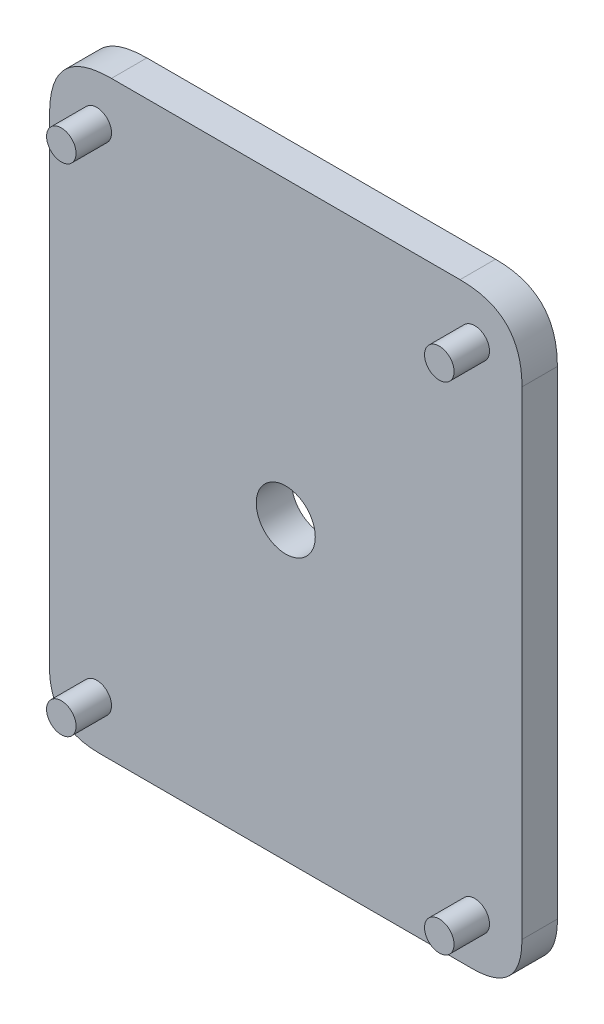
ISO-10303-21;
HEADER;
FILE_DESCRIPTION(('STEP AP214'),'2;1');
FILE_NAME('part.step','',(''),(''),'','','');
FILE_SCHEMA(('AUTOMOTIVE_DESIGN { 1 0 10303 214 1 1 1 1 }'));
ENDSEC;
DATA;
#1=APPLICATION_CONTEXT('core data for automotive mechanical design processes');
#2=APPLICATION_PROTOCOL_DEFINITION('international standard','automotive_design',2000,#1);
#3=PRODUCT_CONTEXT('',#1,'mechanical');
#4=PRODUCT('Part','Part','',(#3));
#5=PRODUCT_RELATED_PRODUCT_CATEGORY('part','',(#4));
#6=PRODUCT_DEFINITION_FORMATION('','',#4);
#7=PRODUCT_DEFINITION_CONTEXT('part definition',#1,'design');
#8=PRODUCT_DEFINITION('design','',#6,#7);
#9=PRODUCT_DEFINITION_SHAPE('','',#8);
#10=(LENGTH_UNIT() NAMED_UNIT(*) SI_UNIT(.MILLI.,.METRE.));
#11=(NAMED_UNIT(*) PLANE_ANGLE_UNIT() SI_UNIT($,.RADIAN.));
#12=(NAMED_UNIT(*) SI_UNIT($,.STERADIAN.) SOLID_ANGLE_UNIT());
#13=UNCERTAINTY_MEASURE_WITH_UNIT(LENGTH_MEASURE(1.E-05),#10,'distance_accuracy_value','');
#14=(GEOMETRIC_REPRESENTATION_CONTEXT(3) GLOBAL_UNCERTAINTY_ASSIGNED_CONTEXT((#13)) GLOBAL_UNIT_ASSIGNED_CONTEXT((#10,
#11,#12)) REPRESENTATION_CONTEXT('',''));
#15=CARTESIAN_POINT('',(0.,0.,0.));
#16=DIRECTION('',(0.,0.,1.));
#17=DIRECTION('',(1.,0.,0.));
#18=AXIS2_PLACEMENT_3D('',#15,#16,#17);
#19=CARTESIAN_POINT('',(20.,0.,3.));
#20=DIRECTION('',(1.,0.,0.));
#21=DIRECTION('',(0.,1.,0.));
#22=AXIS2_PLACEMENT_3D('',#19,#20,#21);
#23=PLANE('',#22);
#24=DIRECTION('',(0.,-1.,0.));
#25=VECTOR('',#24,1.);
#26=CARTESIAN_POINT('',(20.,0.,3.));
#27=LINE('',#26,#25);
#28=CARTESIAN_POINT('',(20.,19.75736,3.));
#29=VERTEX_POINT('',#28);
#30=CARTESIAN_POINT('',(20.,-20.75736,3.));
#31=VERTEX_POINT('',#30);
#32=EDGE_CURVE('E10',#29,#31,#27,.T.);
#33=ORIENTED_EDGE('',*,*,#32,.T.);
#34=CARTESIAN_POINT('',(20.,-20.75736,-0.15));
#35=CARTESIAN_POINT('',(20.,-20.75736,0.95));
#36=CARTESIAN_POINT('',(20.,-20.75736,2.05));
#37=CARTESIAN_POINT('',(20.,-20.75736,3.15));
#38=B_SPLINE_CURVE_WITH_KNOTS('',3,(#34,#35,#36,#37),.UNSPECIFIED.,.F.,.F.,(4,4),(-0.00015,
0.00315),.UNSPECIFIED.);
#39=CARTESIAN_POINT('',(20.,-20.75736,0.));
#40=VERTEX_POINT('',#39);
#41=EDGE_CURVE('E25',#31,#40,#38,.F.);
#42=ORIENTED_EDGE('',*,*,#41,.T.);
#43=DIRECTION('',(0.,-1.,0.));
#44=VECTOR('',#43,1.);
#45=CARTESIAN_POINT('',(20.,0.,0.));
#46=LINE('',#45,#44);
#47=CARTESIAN_POINT('',(20.,19.75736,0.));
#48=VERTEX_POINT('',#47);
#49=EDGE_CURVE('E231',#48,#40,#46,.T.);
#50=ORIENTED_EDGE('',*,*,#49,.F.);
#51=CARTESIAN_POINT('',(20.,19.75736,3.15));
#52=CARTESIAN_POINT('',(20.,19.75736,2.05));
#53=CARTESIAN_POINT('',(20.,19.75736,0.95));
#54=CARTESIAN_POINT('',(20.,19.75736,-0.15));
#55=B_SPLINE_CURVE_WITH_KNOTS('',3,(#51,#52,#53,#54),.UNSPECIFIED.,.F.,.F.,(4,4),(-0.00315,
0.00015),.UNSPECIFIED.);
#56=EDGE_CURVE('E418',#48,#29,#55,.F.);
#57=ORIENTED_EDGE('',*,*,#56,.T.);
#58=EDGE_LOOP('',(#33,#42,#50,#57));
#59=FACE_BOUND('',#58,.T.);
#60=ADVANCED_FACE('F16',(#59),#23,.T.);
#61=CARTESIAN_POINT('',(0.,25.,3.));
#62=DIRECTION('',(0.,-1.,0.));
#63=DIRECTION('',(0.,0.,-1.));
#64=AXIS2_PLACEMENT_3D('',#61,#62,#63);
#65=PLANE('',#64);
#66=DIRECTION('',(-1.,0.,0.));
#67=VECTOR('',#66,1.);
#68=CARTESIAN_POINT('',(0.,25.,0.));
#69=LINE('',#68,#67);
#70=CARTESIAN_POINT('',(14.75736,25.,0.));
#71=VERTEX_POINT('',#70);
#72=CARTESIAN_POINT('',(-14.75736,25.,0.));
#73=VERTEX_POINT('',#72);
#74=EDGE_CURVE('E276',#71,#73,#69,.T.);
#75=ORIENTED_EDGE('',*,*,#74,.T.);
#76=CARTESIAN_POINT('',(-14.75736,25.,3.15));
#77=CARTESIAN_POINT('',(-14.75736,25.,2.05));
#78=CARTESIAN_POINT('',(-14.75736,25.,0.95));
#79=CARTESIAN_POINT('',(-14.75736,25.,-0.15));
#80=B_SPLINE_CURVE_WITH_KNOTS('',3,(#76,#77,#78,#79),.UNSPECIFIED.,.F.,.F.,(4,4),(-0.00015,
0.00315),.UNSPECIFIED.);
#81=CARTESIAN_POINT('',(-14.75736,25.,3.));
#82=VERTEX_POINT('',#81);
#83=EDGE_CURVE('E282',#73,#82,#80,.F.);
#84=ORIENTED_EDGE('',*,*,#83,.T.);
#85=DIRECTION('',(-1.,0.,0.));
#86=VECTOR('',#85,1.);
#87=CARTESIAN_POINT('',(0.,25.,3.));
#88=LINE('',#87,#86);
#89=CARTESIAN_POINT('',(14.75736,25.,3.));
#90=VERTEX_POINT('',#89);
#91=EDGE_CURVE('E290',#90,#82,#88,.T.);
#92=ORIENTED_EDGE('',*,*,#91,.F.);
#93=CARTESIAN_POINT('',(14.75736,25.,-0.15));
#94=CARTESIAN_POINT('',(14.75736,25.,0.95));
#95=CARTESIAN_POINT('',(14.75736,25.,2.05));
#96=CARTESIAN_POINT('',(14.75736,25.,3.15));
#97=B_SPLINE_CURVE_WITH_KNOTS('',3,(#93,#94,#95,#96),.UNSPECIFIED.,.F.,.F.,(4,4),(-0.00315,
0.00015),.UNSPECIFIED.);
#98=EDGE_CURVE('E178',#90,#71,#97,.F.);
#99=ORIENTED_EDGE('',*,*,#98,.T.);
#100=EDGE_LOOP('',(#75,#84,#92,#99));
#101=FACE_BOUND('',#100,.T.);
#102=ADVANCED_FACE('F199',(#101),#65,.F.);
#103=CARTESIAN_POINT('',(-20.,0.,3.));
#104=DIRECTION('',(1.,0.,0.));
#105=DIRECTION('',(0.,1.,0.));
#106=AXIS2_PLACEMENT_3D('',#103,#104,#105);
#107=PLANE('',#106);
#108=DIRECTION('',(0.,-1.,0.));
#109=VECTOR('',#108,1.);
#110=CARTESIAN_POINT('',(-20.,0.,0.));
#111=LINE('',#110,#109);
#112=CARTESIAN_POINT('',(-20.,19.75736,0.));
#113=VERTEX_POINT('',#112);
#114=CARTESIAN_POINT('',(-20.,-20.75736,0.));
#115=VERTEX_POINT('',#114);
#116=EDGE_CURVE('E176',#113,#115,#111,.T.);
#117=ORIENTED_EDGE('',*,*,#116,.T.);
#118=CARTESIAN_POINT('',(-20.,-20.75736,3.15));
#119=CARTESIAN_POINT('',(-20.,-20.75736,2.05));
#120=CARTESIAN_POINT('',(-20.,-20.75736,0.95));
#121=CARTESIAN_POINT('',(-20.,-20.75736,-0.15));
#122=B_SPLINE_CURVE_WITH_KNOTS('',3,(#118,#119,#120,#121),.UNSPECIFIED.,.F.,.F.,(4,4),(-0.00315,
0.00015),.UNSPECIFIED.);
#123=CARTESIAN_POINT('',(-20.,-20.75736,3.));
#124=VERTEX_POINT('',#123);
#125=EDGE_CURVE('E173',#115,#124,#122,.F.);
#126=ORIENTED_EDGE('',*,*,#125,.T.);
#127=DIRECTION('',(0.,-1.,0.));
#128=VECTOR('',#127,1.);
#129=CARTESIAN_POINT('',(-20.,0.,3.));
#130=LINE('',#129,#128);
#131=CARTESIAN_POINT('',(-20.,19.75736,3.));
#132=VERTEX_POINT('',#131);
#133=EDGE_CURVE('E177',#132,#124,#130,.T.);
#134=ORIENTED_EDGE('',*,*,#133,.F.);
#135=CARTESIAN_POINT('',(-20.,19.75736,-0.15));
#136=CARTESIAN_POINT('',(-20.,19.75736,0.95));
#137=CARTESIAN_POINT('',(-20.,19.75736,2.05));
#138=CARTESIAN_POINT('',(-20.,19.75736,3.15));
#139=B_SPLINE_CURVE_WITH_KNOTS('',3,(#135,#136,#137,#138),.UNSPECIFIED.,.F.,.F.,(4,4),(-0.00015,
0.00315),.UNSPECIFIED.);
#140=EDGE_CURVE('E103',#132,#113,#139,.F.);
#141=ORIENTED_EDGE('',*,*,#140,.T.);
#142=EDGE_LOOP('',(#117,#126,#134,#141));
#143=FACE_BOUND('',#142,.T.);
#144=ADVANCED_FACE('F190',(#143),#107,.F.);
#145=CARTESIAN_POINT('',(0.,-25.,3.));
#146=DIRECTION('',(0.,-1.,0.));
#147=DIRECTION('',(0.,0.,-1.));
#148=AXIS2_PLACEMENT_3D('',#145,#146,#147);
#149=PLANE('',#148);
#150=DIRECTION('',(-1.,0.,0.));
#151=VECTOR('',#150,1.);
#152=CARTESIAN_POINT('',(0.,-25.,3.));
#153=LINE('',#152,#151);
#154=CARTESIAN_POINT('',(15.75736,-25.,3.));
#155=VERTEX_POINT('',#154);
#156=CARTESIAN_POINT('',(-15.75736,-25.,3.));
#157=VERTEX_POINT('',#156);
#158=EDGE_CURVE('E82',#155,#157,#153,.T.);
#159=ORIENTED_EDGE('',*,*,#158,.T.);
#160=CARTESIAN_POINT('',(-15.75736,-25.,-0.15));
#161=CARTESIAN_POINT('',(-15.75736,-25.,0.95));
#162=CARTESIAN_POINT('',(-15.75736,-25.,2.05));
#163=CARTESIAN_POINT('',(-15.75736,-25.,3.15));
#164=B_SPLINE_CURVE_WITH_KNOTS('',3,(#160,#161,#162,#163),.UNSPECIFIED.,.F.,.F.,(4,4),(-0.00315,
0.00015),.UNSPECIFIED.);
#165=CARTESIAN_POINT('',(-15.75736,-25.,0.));
#166=VERTEX_POINT('',#165);
#167=EDGE_CURVE('E104',#157,#166,#164,.F.);
#168=ORIENTED_EDGE('',*,*,#167,.T.);
#169=DIRECTION('',(-1.,0.,0.));
#170=VECTOR('',#169,1.);
#171=CARTESIAN_POINT('',(0.,-25.,0.));
#172=LINE('',#171,#170);
#173=CARTESIAN_POINT('',(15.75736,-25.,0.));
#174=VERTEX_POINT('',#173);
#175=EDGE_CURVE('E85',#174,#166,#172,.T.);
#176=ORIENTED_EDGE('',*,*,#175,.F.);
#177=CARTESIAN_POINT('',(15.75736,-25.,3.15));
#178=CARTESIAN_POINT('',(15.75736,-25.,2.05));
#179=CARTESIAN_POINT('',(15.75736,-25.,0.95));
#180=CARTESIAN_POINT('',(15.75736,-25.,-0.15));
#181=B_SPLINE_CURVE_WITH_KNOTS('',3,(#177,#178,#179,#180),.UNSPECIFIED.,.F.,.F.,(4,4),(-0.00015,
0.00315),.UNSPECIFIED.);
#182=EDGE_CURVE('E78',#174,#155,#181,.F.);
#183=ORIENTED_EDGE('',*,*,#182,.T.);
#184=EDGE_LOOP('',(#159,#168,#176,#183));
#185=FACE_BOUND('',#184,.T.);
#186=ADVANCED_FACE('F81',(#185),#149,.T.);
#187=CARTESIAN_POINT('',(0.,0.,3.));
#188=DIRECTION('',(0.,0.,1.));
#189=DIRECTION('',(1.,0.,0.));
#190=AXIS2_PLACEMENT_3D('',#187,#188,#189);
#191=PLANE('',#190);
#192=CARTESIAN_POINT('',(0.,0.,3.));
#193=DIRECTION('',(0.,0.,1.));
#194=DIRECTION('',(1.,0.,0.));
#195=AXIS2_PLACEMENT_3D('',#192,#193,#194);
#196=CIRCLE('',#195,2.5);
#197=CARTESIAN_POINT('',(2.5,0.,3.));
#198=VERTEX_POINT('',#197);
#199=EDGE_CURVE('E91',#198,#198,#196,.T.);
#200=ORIENTED_EDGE('',*,*,#199,.F.);
#201=EDGE_LOOP('',(#200));
#202=FACE_BOUND('',#201,.T.);
#203=CARTESIAN_POINT('',(16.,-21.,3.));
#204=DIRECTION('',(0.,0.,1.));
#205=DIRECTION('',(1.,0.,0.));
#206=AXIS2_PLACEMENT_3D('',#203,#204,#205);
#207=CIRCLE('',#206,1.25);
#208=CARTESIAN_POINT('',(17.25,-21.,3.));
#209=VERTEX_POINT('',#208);
#210=EDGE_CURVE('E375',#209,#209,#207,.T.);
#211=ORIENTED_EDGE('',*,*,#210,.F.);
#212=EDGE_LOOP('',(#211));
#213=FACE_BOUND('',#212,.T.);
#214=CARTESIAN_POINT('',(-16.,-21.,3.));
#215=DIRECTION('',(0.,0.,1.));
#216=DIRECTION('',(1.,0.,0.));
#217=AXIS2_PLACEMENT_3D('',#214,#215,#216);
#218=CIRCLE('',#217,1.25);
#219=CARTESIAN_POINT('',(-14.75,-21.,3.));
#220=VERTEX_POINT('',#219);
#221=EDGE_CURVE('E372',#220,#220,#218,.T.);
#222=ORIENTED_EDGE('',*,*,#221,.F.);
#223=EDGE_LOOP('',(#222));
#224=FACE_BOUND('',#223,.T.);
#225=CARTESIAN_POINT('',(16.,21.,3.));
#226=DIRECTION('',(0.,0.,1.));
#227=DIRECTION('',(1.,0.,0.));
#228=AXIS2_PLACEMENT_3D('',#225,#226,#227);
#229=CIRCLE('',#228,1.25);
#230=CARTESIAN_POINT('',(17.25,21.,3.));
#231=VERTEX_POINT('',#230);
#232=EDGE_CURVE('E369',#231,#231,#229,.T.);
#233=ORIENTED_EDGE('',*,*,#232,.F.);
#234=EDGE_LOOP('',(#233));
#235=FACE_BOUND('',#234,.T.);
#236=CARTESIAN_POINT('',(-16.,21.,3.));
#237=DIRECTION('',(0.,0.,1.));
#238=DIRECTION('',(1.,0.,0.));
#239=AXIS2_PLACEMENT_3D('',#236,#237,#238);
#240=CIRCLE('',#239,1.25);
#241=CARTESIAN_POINT('',(-14.75,21.,3.));
#242=VERTEX_POINT('',#241);
#243=EDGE_CURVE('E366',#242,#242,#240,.T.);
#244=ORIENTED_EDGE('',*,*,#243,.F.);
#245=EDGE_LOOP('',(#244));
#246=FACE_BOUND('',#245,.T.);
#247=ORIENTED_EDGE('',*,*,#133,.T.);
#248=CARTESIAN_POINT('',(-15.75736,-25.,3.));
#249=CARTESIAN_POINT('',(-20.,-25.,3.));
#250=CARTESIAN_POINT('',(-20.,-20.75736,3.));
#251=B_SPLINE_CURVE_WITH_KNOTS('',2,(#248,#249,#250),.UNSPECIFIED.,.F.,.F.,(3,3),(0.,1.),.UNSPECIFIED.);
#252=EDGE_CURVE('E100',#124,#157,#251,.F.);
#253=ORIENTED_EDGE('',*,*,#252,.T.);
#254=ORIENTED_EDGE('',*,*,#158,.F.);
#255=CARTESIAN_POINT('',(20.,-20.75736,3.));
#256=CARTESIAN_POINT('',(20.,-25.,3.));
#257=CARTESIAN_POINT('',(15.75736,-25.,3.));
#258=B_SPLINE_CURVE_WITH_KNOTS('',2,(#255,#256,#257),.UNSPECIFIED.,.F.,.F.,(3,3),(0.,1.),.UNSPECIFIED.);
#259=EDGE_CURVE('E97',#155,#31,#258,.F.);
#260=ORIENTED_EDGE('',*,*,#259,.T.);
#261=ORIENTED_EDGE('',*,*,#32,.F.);
#262=CARTESIAN_POINT('',(14.75736,25.,3.));
#263=CARTESIAN_POINT('',(20.,25.,3.));
#264=CARTESIAN_POINT('',(20.,19.75736,3.));
#265=B_SPLINE_CURVE_WITH_KNOTS('',2,(#262,#263,#264),.UNSPECIFIED.,.F.,.F.,(3,3),(0.,1.),.UNSPECIFIED.);
#266=EDGE_CURVE('E109',#29,#90,#265,.F.);
#267=ORIENTED_EDGE('',*,*,#266,.T.);
#268=ORIENTED_EDGE('',*,*,#91,.T.);
#269=CARTESIAN_POINT('',(-20.,19.75736,3.));
#270=CARTESIAN_POINT('',(-20.,25.,3.));
#271=CARTESIAN_POINT('',(-14.75736,25.,3.));
#272=B_SPLINE_CURVE_WITH_KNOTS('',2,(#269,#270,#271),.UNSPECIFIED.,.F.,.F.,(3,3),(0.,1.),.UNSPECIFIED.);
#273=EDGE_CURVE('E285',#82,#132,#272,.F.);
#274=ORIENTED_EDGE('',*,*,#273,.T.);
#275=EDGE_LOOP('',(#247,#253,#254,#260,#261,#267,#268,#274));
#276=FACE_BOUND('',#275,.T.);
#277=ADVANCED_FACE('F96',(#202,#213,#224,#235,#246,#276),#191,.T.);
#278=CARTESIAN_POINT('',(0.,0.,0.));
#279=DIRECTION('',(0.,0.,1.));
#280=DIRECTION('',(1.,0.,0.));
#281=AXIS2_PLACEMENT_3D('',#278,#279,#280);
#282=PLANE('',#281);
#283=CARTESIAN_POINT('',(0.,0.,0.));
#284=DIRECTION('',(0.,0.,1.));
#285=DIRECTION('',(1.,0.,0.));
#286=AXIS2_PLACEMENT_3D('',#283,#284,#285);
#287=CIRCLE('',#286,2.5);
#288=CARTESIAN_POINT('',(2.5,0.,0.));
#289=VERTEX_POINT('',#288);
#290=EDGE_CURVE('E333',#289,#289,#287,.T.);
#291=ORIENTED_EDGE('',*,*,#290,.T.);
#292=EDGE_LOOP('',(#291));
#293=FACE_BOUND('',#292,.T.);
#294=ORIENTED_EDGE('',*,*,#175,.T.);
#295=CARTESIAN_POINT('',(-20.,-20.75736,0.));
#296=CARTESIAN_POINT('',(-20.,-25.,0.));
#297=CARTESIAN_POINT('',(-15.75736,-25.,0.));
#298=B_SPLINE_CURVE_WITH_KNOTS('',2,(#295,#296,#297),.UNSPECIFIED.,.F.,.F.,(3,3),(0.,1.),.UNSPECIFIED.);
#299=EDGE_CURVE('E165',#166,#115,#298,.F.);
#300=ORIENTED_EDGE('',*,*,#299,.T.);
#301=ORIENTED_EDGE('',*,*,#116,.F.);
#302=CARTESIAN_POINT('',(-14.75736,25.,0.));
#303=CARTESIAN_POINT('',(-20.,25.,0.));
#304=CARTESIAN_POINT('',(-20.,19.75736,0.));
#305=B_SPLINE_CURVE_WITH_KNOTS('',2,(#302,#303,#304),.UNSPECIFIED.,.F.,.F.,(3,3),(0.,1.),.UNSPECIFIED.);
#306=EDGE_CURVE('E274',#113,#73,#305,.F.);
#307=ORIENTED_EDGE('',*,*,#306,.T.);
#308=ORIENTED_EDGE('',*,*,#74,.F.);
#309=CARTESIAN_POINT('',(20.,19.75736,0.));
#310=CARTESIAN_POINT('',(20.,25.,0.));
#311=CARTESIAN_POINT('',(14.75736,25.,0.));
#312=B_SPLINE_CURVE_WITH_KNOTS('',2,(#309,#310,#311),.UNSPECIFIED.,.F.,.F.,(3,3),(0.,1.),.UNSPECIFIED.);
#313=EDGE_CURVE('E233',#71,#48,#312,.F.);
#314=ORIENTED_EDGE('',*,*,#313,.T.);
#315=ORIENTED_EDGE('',*,*,#49,.T.);
#316=CARTESIAN_POINT('',(15.75736,-25.,0.));
#317=CARTESIAN_POINT('',(20.,-25.,0.));
#318=CARTESIAN_POINT('',(20.,-20.75736,0.));
#319=B_SPLINE_CURVE_WITH_KNOTS('',2,(#316,#317,#318),.UNSPECIFIED.,.F.,.F.,(3,3),(0.,1.),.UNSPECIFIED.);
#320=EDGE_CURVE('E228',#40,#174,#319,.F.);
#321=ORIENTED_EDGE('',*,*,#320,.T.);
#322=EDGE_LOOP('',(#294,#300,#301,#307,#308,#314,#315,#321));
#323=FACE_BOUND('',#322,.T.);
#324=ADVANCED_FACE('F225',(#293,#323),#282,.F.);
#325=CARTESIAN_POINT('',(-16.,21.,6.));
#326=DIRECTION('',(0.,0.,-1.));
#327=DIRECTION('',(-1.,0.,0.));
#328=AXIS2_PLACEMENT_3D('',#325,#326,#327);
#329=CYLINDRICAL_SURFACE('',#328,1.25);
#330=CARTESIAN_POINT('',(-16.,21.,6.));
#331=DIRECTION('',(0.,0.,1.));
#332=DIRECTION('',(1.,0.,0.));
#333=AXIS2_PLACEMENT_3D('',#330,#331,#332);
#334=CIRCLE('',#333,1.25);
#335=CARTESIAN_POINT('',(-14.75,21.,6.));
#336=VERTEX_POINT('',#335);
#337=EDGE_CURVE('E234',#336,#336,#334,.T.);
#338=ORIENTED_EDGE('',*,*,#337,.F.);
#339=EDGE_LOOP('',(#338));
#340=FACE_BOUND('',#339,.T.);
#341=ORIENTED_EDGE('',*,*,#243,.T.);
#342=EDGE_LOOP('',(#341));
#343=FACE_BOUND('',#342,.T.);
#344=ADVANCED_FACE('F253',(#340,#343),#329,.T.);
#345=CARTESIAN_POINT('',(0.,0.,6.));
#346=DIRECTION('',(0.,0.,1.));
#347=DIRECTION('',(1.,0.,0.));
#348=AXIS2_PLACEMENT_3D('',#345,#346,#347);
#349=PLANE('',#348);
#350=ORIENTED_EDGE('',*,*,#337,.T.);
#351=EDGE_LOOP('',(#350));
#352=FACE_BOUND('',#351,.T.);
#353=ADVANCED_FACE('F401',(#352),#349,.T.);
#354=CARTESIAN_POINT('',(16.,21.,6.));
#355=DIRECTION('',(0.,0.,-1.));
#356=DIRECTION('',(-1.,0.,0.));
#357=AXIS2_PLACEMENT_3D('',#354,#355,#356);
#358=CYLINDRICAL_SURFACE('',#357,1.25);
#359=CARTESIAN_POINT('',(16.,21.,6.));
#360=DIRECTION('',(0.,0.,-1.));
#361=DIRECTION('',(1.,0.,0.));
#362=AXIS2_PLACEMENT_3D('',#359,#360,#361);
#363=CIRCLE('',#362,1.25);
#364=CARTESIAN_POINT('',(17.25,21.,6.));
#365=VERTEX_POINT('',#364);
#366=EDGE_CURVE('E646',#365,#365,#363,.T.);
#367=ORIENTED_EDGE('',*,*,#366,.T.);
#368=EDGE_LOOP('',(#367));
#369=FACE_BOUND('',#368,.T.);
#370=ORIENTED_EDGE('',*,*,#232,.T.);
#371=EDGE_LOOP('',(#370));
#372=FACE_BOUND('',#371,.T.);
#373=ADVANCED_FACE('F407',(#369,#372),#358,.T.);
#374=CARTESIAN_POINT('',(0.,0.,6.));
#375=DIRECTION('',(0.,0.,1.));
#376=DIRECTION('',(1.,0.,0.));
#377=AXIS2_PLACEMENT_3D('',#374,#375,#376);
#378=PLANE('',#377);
#379=ORIENTED_EDGE('',*,*,#366,.F.);
#380=EDGE_LOOP('',(#379));
#381=FACE_BOUND('',#380,.T.);
#382=ADVANCED_FACE('F571',(#381),#378,.T.);
#383=CARTESIAN_POINT('',(-16.,-21.,6.));
#384=DIRECTION('',(0.,0.,-1.));
#385=DIRECTION('',(-1.,0.,0.));
#386=AXIS2_PLACEMENT_3D('',#383,#384,#385);
#387=CYLINDRICAL_SURFACE('',#386,1.25);
#388=CARTESIAN_POINT('',(-16.,-21.,6.));
#389=DIRECTION('',(0.,0.,-1.));
#390=DIRECTION('',(1.,0.,0.));
#391=AXIS2_PLACEMENT_3D('',#388,#389,#390);
#392=CIRCLE('',#391,1.25);
#393=CARTESIAN_POINT('',(-14.75,-21.,6.));
#394=VERTEX_POINT('',#393);
#395=EDGE_CURVE('E647',#394,#394,#392,.T.);
#396=ORIENTED_EDGE('',*,*,#395,.T.);
#397=EDGE_LOOP('',(#396));
#398=FACE_BOUND('',#397,.T.);
#399=ORIENTED_EDGE('',*,*,#221,.T.);
#400=EDGE_LOOP('',(#399));
#401=FACE_BOUND('',#400,.T.);
#402=ADVANCED_FACE('F562',(#398,#401),#387,.T.);
#403=CARTESIAN_POINT('',(0.,0.,6.));
#404=DIRECTION('',(0.,0.,1.));
#405=DIRECTION('',(1.,0.,0.));
#406=AXIS2_PLACEMENT_3D('',#403,#404,#405);
#407=PLANE('',#406);
#408=ORIENTED_EDGE('',*,*,#395,.F.);
#409=EDGE_LOOP('',(#408));
#410=FACE_BOUND('',#409,.T.);
#411=ADVANCED_FACE('F553',(#410),#407,.T.);
#412=CARTESIAN_POINT('',(16.,-21.,6.));
#413=DIRECTION('',(0.,0.,-1.));
#414=DIRECTION('',(-1.,0.,0.));
#415=AXIS2_PLACEMENT_3D('',#412,#413,#414);
#416=CYLINDRICAL_SURFACE('',#415,1.25);
#417=CARTESIAN_POINT('',(16.,-21.,6.));
#418=DIRECTION('',(0.,0.,1.));
#419=DIRECTION('',(1.,0.,0.));
#420=AXIS2_PLACEMENT_3D('',#417,#418,#419);
#421=CIRCLE('',#420,1.25);
#422=CARTESIAN_POINT('',(17.25,-21.,6.));
#423=VERTEX_POINT('',#422);
#424=EDGE_CURVE('E651',#423,#423,#421,.T.);
#425=ORIENTED_EDGE('',*,*,#424,.F.);
#426=EDGE_LOOP('',(#425));
#427=FACE_BOUND('',#426,.T.);
#428=ORIENTED_EDGE('',*,*,#210,.T.);
#429=EDGE_LOOP('',(#428));
#430=FACE_BOUND('',#429,.T.);
#431=ADVANCED_FACE('F545',(#427,#430),#416,.T.);
#432=CARTESIAN_POINT('',(0.,0.,6.));
#433=DIRECTION('',(0.,0.,1.));
#434=DIRECTION('',(1.,0.,0.));
#435=AXIS2_PLACEMENT_3D('',#432,#433,#434);
#436=PLANE('',#435);
#437=ORIENTED_EDGE('',*,*,#424,.T.);
#438=EDGE_LOOP('',(#437));
#439=FACE_BOUND('',#438,.T.);
#440=ADVANCED_FACE('F538',(#439),#436,.T.);
#441=CARTESIAN_POINT('',(0.,0.,-22.));
#442=DIRECTION('',(0.,0.,1.));
#443=DIRECTION('',(1.,0.,0.));
#444=AXIS2_PLACEMENT_3D('',#441,#442,#443);
#445=CYLINDRICAL_SURFACE('',#444,2.5);
#446=ORIENTED_EDGE('',*,*,#199,.T.);
#447=EDGE_LOOP('',(#446));
#448=FACE_BOUND('',#447,.T.);
#449=ORIENTED_EDGE('',*,*,#290,.F.);
#450=EDGE_LOOP('',(#449));
#451=FACE_BOUND('',#450,.T.);
#452=ADVANCED_FACE('F308',(#448,#451),#445,.F.);
#453=CARTESIAN_POINT('',(-20.,19.75736,3.15));
#454=CARTESIAN_POINT('',(-20.,19.75736,2.05));
#455=CARTESIAN_POINT('',(-20.,19.75736,0.95));
#456=CARTESIAN_POINT('',(-20.,19.75736,-0.15));
#457=CARTESIAN_POINT('',(-20.,25.,3.15));
#458=CARTESIAN_POINT('',(-20.,25.,2.05));
#459=CARTESIAN_POINT('',(-20.,25.,0.95));
#460=CARTESIAN_POINT('',(-20.,25.,-0.15));
#461=CARTESIAN_POINT('',(-14.75736,25.,3.15));
#462=CARTESIAN_POINT('',(-14.75736,25.,2.05));
#463=CARTESIAN_POINT('',(-14.75736,25.,0.95));
#464=CARTESIAN_POINT('',(-14.75736,25.,-0.15));
#465=B_SPLINE_SURFACE_WITH_KNOTS('',2,3,((#453,#454,#455,#456),(#457,#458,#459,#460),(#461,#462,
#463,#464)),.UNSPECIFIED.,.F.,.F.,.F.,(3,3),(4,4),(0.,1.),(-0.00015,0.00315),.UNSPECIFIED.);
#466=ORIENTED_EDGE('',*,*,#273,.F.);
#467=ORIENTED_EDGE('',*,*,#83,.F.);
#468=ORIENTED_EDGE('',*,*,#306,.F.);
#469=ORIENTED_EDGE('',*,*,#140,.F.);
#470=EDGE_LOOP('',(#466,#467,#468,#469));
#471=FACE_BOUND('',#470,.T.);
#472=ADVANCED_FACE('F284',(#471),#465,.T.);
#473=CARTESIAN_POINT('',(20.,19.75736,-0.15));
#474=CARTESIAN_POINT('',(20.,19.75736,0.95));
#475=CARTESIAN_POINT('',(20.,19.75736,2.05));
#476=CARTESIAN_POINT('',(20.,19.75736,3.15));
#477=CARTESIAN_POINT('',(20.,25.,-0.15));
#478=CARTESIAN_POINT('',(20.,25.,0.95));
#479=CARTESIAN_POINT('',(20.,25.,2.05));
#480=CARTESIAN_POINT('',(20.,25.,3.15));
#481=CARTESIAN_POINT('',(14.75736,25.,-0.15));
#482=CARTESIAN_POINT('',(14.75736,25.,0.95));
#483=CARTESIAN_POINT('',(14.75736,25.,2.05));
#484=CARTESIAN_POINT('',(14.75736,25.,3.15));
#485=B_SPLINE_SURFACE_WITH_KNOTS('',2,3,((#473,#474,#475,#476),(#477,#478,#479,#480),(#481,#482,
#483,#484)),.UNSPECIFIED.,.F.,.F.,.F.,(3,3),(4,4),(0.,1.),(-0.00315,0.00015),.UNSPECIFIED.);
#486=ORIENTED_EDGE('',*,*,#266,.F.);
#487=ORIENTED_EDGE('',*,*,#56,.F.);
#488=ORIENTED_EDGE('',*,*,#313,.F.);
#489=ORIENTED_EDGE('',*,*,#98,.F.);
#490=EDGE_LOOP('',(#486,#487,#488,#489));
#491=FACE_BOUND('',#490,.T.);
#492=ADVANCED_FACE('F131',(#491),#485,.T.);
#493=CARTESIAN_POINT('',(-20.,-20.75736,-0.15));
#494=CARTESIAN_POINT('',(-20.,-20.75736,0.95));
#495=CARTESIAN_POINT('',(-20.,-20.75736,2.05));
#496=CARTESIAN_POINT('',(-20.,-20.75736,3.15));
#497=CARTESIAN_POINT('',(-20.,-25.,-0.15));
#498=CARTESIAN_POINT('',(-20.,-25.,0.95));
#499=CARTESIAN_POINT('',(-20.,-25.,2.05));
#500=CARTESIAN_POINT('',(-20.,-25.,3.15));
#501=CARTESIAN_POINT('',(-15.75736,-25.,-0.15));
#502=CARTESIAN_POINT('',(-15.75736,-25.,0.95));
#503=CARTESIAN_POINT('',(-15.75736,-25.,2.05));
#504=CARTESIAN_POINT('',(-15.75736,-25.,3.15));
#505=B_SPLINE_SURFACE_WITH_KNOTS('',2,3,((#493,#494,#495,#496),(#497,#498,#499,#500),(#501,#502,
#503,#504)),.UNSPECIFIED.,.F.,.F.,.F.,(3,3),(4,4),(0.,1.),(-0.00315,0.00015),.UNSPECIFIED.);
#506=ORIENTED_EDGE('',*,*,#252,.F.);
#507=ORIENTED_EDGE('',*,*,#125,.F.);
#508=ORIENTED_EDGE('',*,*,#299,.F.);
#509=ORIENTED_EDGE('',*,*,#167,.F.);
#510=EDGE_LOOP('',(#506,#507,#508,#509));
#511=FACE_BOUND('',#510,.T.);
#512=ADVANCED_FACE('F120',(#511),#505,.T.);
#513=CARTESIAN_POINT('',(20.,-20.75736,3.15));
#514=CARTESIAN_POINT('',(20.,-20.75736,2.05));
#515=CARTESIAN_POINT('',(20.,-20.75736,0.95));
#516=CARTESIAN_POINT('',(20.,-20.75736,-0.15));
#517=CARTESIAN_POINT('',(20.,-25.,3.15));
#518=CARTESIAN_POINT('',(20.,-25.,2.05));
#519=CARTESIAN_POINT('',(20.,-25.,0.95));
#520=CARTESIAN_POINT('',(20.,-25.,-0.15));
#521=CARTESIAN_POINT('',(15.75736,-25.,3.15));
#522=CARTESIAN_POINT('',(15.75736,-25.,2.05));
#523=CARTESIAN_POINT('',(15.75736,-25.,0.95));
#524=CARTESIAN_POINT('',(15.75736,-25.,-0.15));
#525=B_SPLINE_SURFACE_WITH_KNOTS('',2,3,((#513,#514,#515,#516),(#517,#518,#519,#520),(#521,#522,
#523,#524)),.UNSPECIFIED.,.F.,.F.,.F.,(3,3),(4,4),(0.,1.),(-0.00015,0.00315),.UNSPECIFIED.);
#526=ORIENTED_EDGE('',*,*,#259,.F.);
#527=ORIENTED_EDGE('',*,*,#182,.F.);
#528=ORIENTED_EDGE('',*,*,#320,.F.);
#529=ORIENTED_EDGE('',*,*,#41,.F.);
#530=EDGE_LOOP('',(#526,#527,#528,#529));
#531=FACE_BOUND('',#530,.T.);
#532=ADVANCED_FACE('F107',(#531),#525,.T.);
#533=CLOSED_SHELL('',(#60,#102,#144,#186,#277,#324,#344,#353,#373,#382,#402,#411,#431,#440,#452,
#472,#492,#512,#532));
#534=MANIFOLD_SOLID_BREP('B1',#533);
#535=ADVANCED_BREP_SHAPE_REPRESENTATION('',(#18,#534),#14);
#536=SHAPE_DEFINITION_REPRESENTATION(#9,#535);
ENDSEC;
END-ISO-10303-21;
